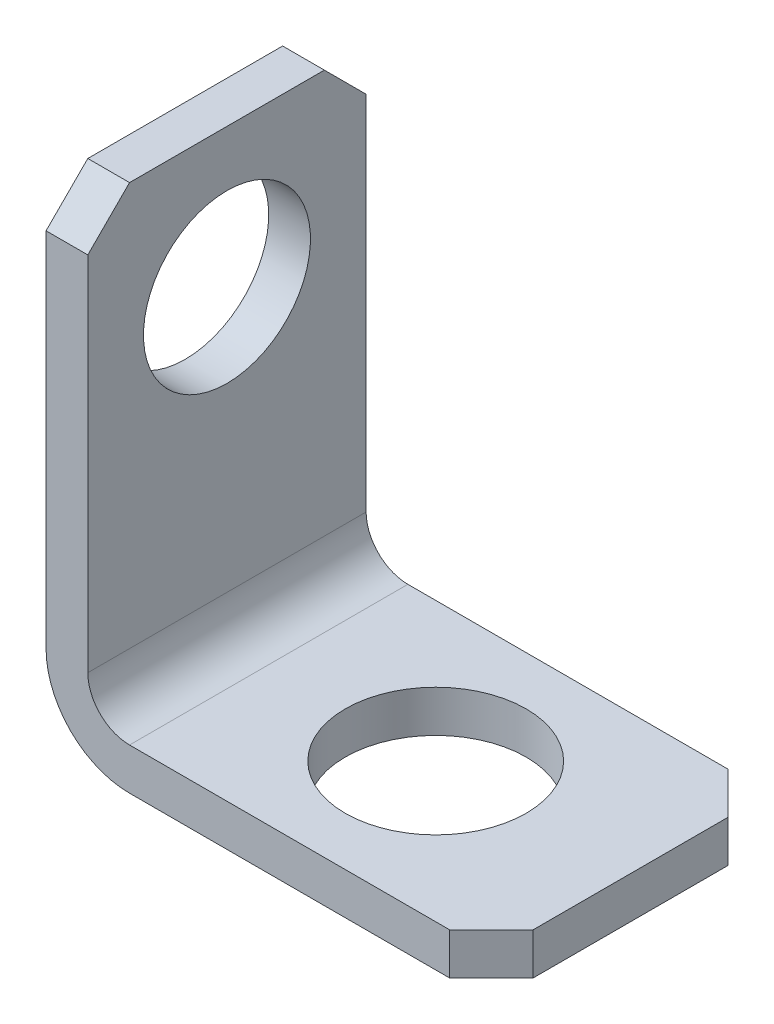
ISO-10303-21;
HEADER;
FILE_DESCRIPTION(('STEP AP214'),'2;1');
FILE_NAME('part.step','',(''),(''),'','','');
FILE_SCHEMA(('AUTOMOTIVE_DESIGN { 1 0 10303 214 1 1 1 1 }'));
ENDSEC;
DATA;
#1=APPLICATION_CONTEXT('core data for automotive mechanical design processes');
#2=APPLICATION_PROTOCOL_DEFINITION('international standard','automotive_design',2000,#1);
#3=PRODUCT_CONTEXT('',#1,'mechanical');
#4=PRODUCT('Part','Part','',(#3));
#5=PRODUCT_RELATED_PRODUCT_CATEGORY('part','',(#4));
#6=PRODUCT_DEFINITION_FORMATION('','',#4);
#7=PRODUCT_DEFINITION_CONTEXT('part definition',#1,'design');
#8=PRODUCT_DEFINITION('design','',#6,#7);
#9=PRODUCT_DEFINITION_SHAPE('','',#8);
#10=(LENGTH_UNIT() NAMED_UNIT(*) SI_UNIT(.MILLI.,.METRE.));
#11=(NAMED_UNIT(*) PLANE_ANGLE_UNIT() SI_UNIT($,.RADIAN.));
#12=(NAMED_UNIT(*) SI_UNIT($,.STERADIAN.) SOLID_ANGLE_UNIT());
#13=UNCERTAINTY_MEASURE_WITH_UNIT(LENGTH_MEASURE(1.E-05),#10,'distance_accuracy_value','');
#14=(GEOMETRIC_REPRESENTATION_CONTEXT(3) GLOBAL_UNCERTAINTY_ASSIGNED_CONTEXT((#13)) GLOBAL_UNIT_ASSIGNED_CONTEXT((#10,
#11,#12)) REPRESENTATION_CONTEXT('',''));
#15=CARTESIAN_POINT('',(0.,0.,0.));
#16=DIRECTION('',(0.,0.,1.));
#17=DIRECTION('',(1.,0.,0.));
#18=AXIS2_PLACEMENT_3D('',#15,#16,#17);
#19=CARTESIAN_POINT('',(3.,35.,20.));
#20=DIRECTION('',(0.,-1.,0.));
#21=DIRECTION('',(0.,0.,-1.));
#22=AXIS2_PLACEMENT_3D('',#19,#20,#21);
#23=PLANE('',#22);
#24=DIRECTION('',(0.,0.,-1.));
#25=VECTOR('',#24,1.);
#26=CARTESIAN_POINT('',(3.,35.,20.));
#27=LINE('',#26,#25);
#28=CARTESIAN_POINT('',(3.,35.,17.));
#29=VERTEX_POINT('',#28);
#30=CARTESIAN_POINT('',(3.,35.,3.));
#31=VERTEX_POINT('',#30);
#32=EDGE_CURVE('E140',#29,#31,#27,.T.);
#33=ORIENTED_EDGE('',*,*,#32,.T.);
#34=DIRECTION('',(-1.,0.,0.));
#35=VECTOR('',#34,1.);
#36=CARTESIAN_POINT('',(3.,35.,3.));
#37=LINE('',#36,#35);
#38=CARTESIAN_POINT('',(0.,35.,3.));
#39=VERTEX_POINT('',#38);
#40=EDGE_CURVE('E186',#31,#39,#37,.T.);
#41=ORIENTED_EDGE('',*,*,#40,.T.);
#42=DIRECTION('',(0.,0.,-1.));
#43=VECTOR('',#42,1.);
#44=CARTESIAN_POINT('',(0.,35.,20.));
#45=LINE('',#44,#43);
#46=CARTESIAN_POINT('',(0.,35.,17.));
#47=VERTEX_POINT('',#46);
#48=EDGE_CURVE('E125',#47,#39,#45,.T.);
#49=ORIENTED_EDGE('',*,*,#48,.F.);
#50=DIRECTION('',(1.,0.,0.));
#51=VECTOR('',#50,1.);
#52=CARTESIAN_POINT('',(3.,35.,17.));
#53=LINE('',#52,#51);
#54=EDGE_CURVE('E38',#47,#29,#53,.T.);
#55=ORIENTED_EDGE('',*,*,#54,.T.);
#56=EDGE_LOOP('',(#33,#41,#49,#55));
#57=FACE_BOUND('',#56,.T.);
#58=ADVANCED_FACE('F17',(#57),#23,.F.);
#59=CARTESIAN_POINT('',(0.,35.,20.));
#60=DIRECTION('',(1.,0.,0.));
#61=DIRECTION('',(0.,1.,0.));
#62=AXIS2_PLACEMENT_3D('',#59,#60,#61);
#63=PLANE('',#62);
#64=CARTESIAN_POINT('',(0.,25.,10.));
#65=DIRECTION('',(-1.,0.,0.));
#66=DIRECTION('',(0.,-1.,0.));
#67=AXIS2_PLACEMENT_3D('',#64,#65,#66);
#68=CIRCLE('',#67,6.);
#69=CARTESIAN_POINT('',(0.,19.,10.));
#70=VERTEX_POINT('',#69);
#71=EDGE_CURVE('E213',#70,#70,#68,.T.);
#72=ORIENTED_EDGE('',*,*,#71,.F.);
#73=EDGE_LOOP('',(#72));
#74=FACE_BOUND('',#73,.T.);
#75=ORIENTED_EDGE('',*,*,#48,.T.);
#76=DIRECTION('',(0.,0.707106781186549,0.707106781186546));
#77=VECTOR('',#76,1.);
#78=CARTESIAN_POINT('',(0.,35.,3.));
#79=LINE('',#78,#77);
#80=CARTESIAN_POINT('',(0.,32.,0.));
#81=VERTEX_POINT('',#80);
#82=EDGE_CURVE('E191',#39,#81,#79,.F.);
#83=ORIENTED_EDGE('',*,*,#82,.T.);
#84=DIRECTION('',(0.,-1.,0.));
#85=VECTOR('',#84,1.);
#86=CARTESIAN_POINT('',(0.,35.,0.));
#87=LINE('',#86,#85);
#88=CARTESIAN_POINT('',(0.,6.,0.));
#89=VERTEX_POINT('',#88);
#90=EDGE_CURVE('E207',#81,#89,#87,.T.);
#91=ORIENTED_EDGE('',*,*,#90,.T.);
#92=DIRECTION('',(0.,0.,-1.));
#93=VECTOR('',#92,1.);
#94=CARTESIAN_POINT('',(0.,6.,20.));
#95=LINE('',#94,#93);
#96=CARTESIAN_POINT('',(0.,6.,20.));
#97=VERTEX_POINT('',#96);
#98=EDGE_CURVE('E158',#89,#97,#95,.F.);
#99=ORIENTED_EDGE('',*,*,#98,.T.);
#100=DIRECTION('',(0.,-1.,0.));
#101=VECTOR('',#100,1.);
#102=CARTESIAN_POINT('',(0.,35.,20.));
#103=LINE('',#102,#101);
#104=CARTESIAN_POINT('',(0.,32.,20.));
#105=VERTEX_POINT('',#104);
#106=EDGE_CURVE('E131',#105,#97,#103,.T.);
#107=ORIENTED_EDGE('',*,*,#106,.F.);
#108=DIRECTION('',(0.,0.707106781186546,-0.70710678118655));
#109=VECTOR('',#108,1.);
#110=CARTESIAN_POINT('',(0.,32.,20.));
#111=LINE('',#110,#109);
#112=EDGE_CURVE('E189',#105,#47,#111,.T.);
#113=ORIENTED_EDGE('',*,*,#112,.T.);
#114=EDGE_LOOP('',(#75,#83,#91,#99,#107,#113));
#115=FACE_BOUND('',#114,.T.);
#116=ADVANCED_FACE('F203',(#74,#115),#63,.F.);
#117=CARTESIAN_POINT('',(0.,0.,20.));
#118=DIRECTION('',(0.,1.,0.));
#119=DIRECTION('',(-1.,0.,0.));
#120=AXIS2_PLACEMENT_3D('',#117,#118,#119);
#121=PLANE('',#120);
#122=CARTESIAN_POINT('',(18.,0.,10.));
#123=DIRECTION('',(0.,1.,0.));
#124=DIRECTION('',(-1.,0.,0.));
#125=AXIS2_PLACEMENT_3D('',#122,#123,#124);
#126=CIRCLE('',#125,6.5);
#127=CARTESIAN_POINT('',(11.5,0.,10.));
#128=VERTEX_POINT('',#127);
#129=EDGE_CURVE('E219',#128,#128,#126,.T.);
#130=ORIENTED_EDGE('',*,*,#129,.T.);
#131=EDGE_LOOP('',(#130));
#132=FACE_BOUND('',#131,.T.);
#133=DIRECTION('',(0.,0.,-1.));
#134=VECTOR('',#133,1.);
#135=CARTESIAN_POINT('',(32.,0.,20.));
#136=LINE('',#135,#134);
#137=CARTESIAN_POINT('',(32.,0.,17.));
#138=VERTEX_POINT('',#137);
#139=CARTESIAN_POINT('',(32.,0.,3.));
#140=VERTEX_POINT('',#139);
#141=EDGE_CURVE('E145',#138,#140,#136,.T.);
#142=ORIENTED_EDGE('',*,*,#141,.F.);
#143=DIRECTION('',(-0.707106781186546,0.,0.707106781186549));
#144=VECTOR('',#143,1.);
#145=CARTESIAN_POINT('',(29.,0.,20.));
#146=LINE('',#145,#144);
#147=CARTESIAN_POINT('',(29.,0.,20.));
#148=VERTEX_POINT('',#147);
#149=EDGE_CURVE('E180',#138,#148,#146,.T.);
#150=ORIENTED_EDGE('',*,*,#149,.T.);
#151=DIRECTION('',(1.,0.,0.));
#152=VECTOR('',#151,1.);
#153=CARTESIAN_POINT('',(0.,0.,20.));
#154=LINE('',#153,#152);
#155=CARTESIAN_POINT('',(6.,0.,20.));
#156=VERTEX_POINT('',#155);
#157=EDGE_CURVE('E134',#156,#148,#154,.T.);
#158=ORIENTED_EDGE('',*,*,#157,.F.);
#159=DIRECTION('',(0.,0.,-1.));
#160=VECTOR('',#159,1.);
#161=CARTESIAN_POINT('',(6.,0.,20.));
#162=LINE('',#161,#160);
#163=CARTESIAN_POINT('',(6.,0.,0.));
#164=VERTEX_POINT('',#163);
#165=EDGE_CURVE('E152',#156,#164,#162,.T.);
#166=ORIENTED_EDGE('',*,*,#165,.T.);
#167=DIRECTION('',(1.,0.,0.));
#168=VECTOR('',#167,1.);
#169=CARTESIAN_POINT('',(0.,0.,0.));
#170=LINE('',#169,#168);
#171=CARTESIAN_POINT('',(29.,0.,0.));
#172=VERTEX_POINT('',#171);
#173=EDGE_CURVE('E136',#164,#172,#170,.T.);
#174=ORIENTED_EDGE('',*,*,#173,.T.);
#175=DIRECTION('',(-0.707106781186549,0.,-0.707106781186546));
#176=VECTOR('',#175,1.);
#177=CARTESIAN_POINT('',(32.,0.,3.));
#178=LINE('',#177,#176);
#179=EDGE_CURVE('E178',#172,#140,#178,.F.);
#180=ORIENTED_EDGE('',*,*,#179,.T.);
#181=EDGE_LOOP('',(#142,#150,#158,#166,#174,#180));
#182=FACE_BOUND('',#181,.T.);
#183=ADVANCED_FACE('F226',(#132,#182),#121,.F.);
#184=CARTESIAN_POINT('',(32.,0.,20.));
#185=DIRECTION('',(-1.,0.,0.));
#186=DIRECTION('',(0.,-1.,0.));
#187=AXIS2_PLACEMENT_3D('',#184,#185,#186);
#188=PLANE('',#187);
#189=DIRECTION('',(0.,0.,-1.));
#190=VECTOR('',#189,1.);
#191=CARTESIAN_POINT('',(32.,3.,20.));
#192=LINE('',#191,#190);
#193=CARTESIAN_POINT('',(32.,3.,17.));
#194=VERTEX_POINT('',#193);
#195=CARTESIAN_POINT('',(32.,3.,3.));
#196=VERTEX_POINT('',#195);
#197=EDGE_CURVE('E142',#194,#196,#192,.T.);
#198=ORIENTED_EDGE('',*,*,#197,.F.);
#199=DIRECTION('',(0.,-1.,0.));
#200=VECTOR('',#199,1.);
#201=CARTESIAN_POINT('',(32.,0.,17.));
#202=LINE('',#201,#200);
#203=EDGE_CURVE('E176',#194,#138,#202,.T.);
#204=ORIENTED_EDGE('',*,*,#203,.T.);
#205=ORIENTED_EDGE('',*,*,#141,.T.);
#206=DIRECTION('',(0.,1.,0.));
#207=VECTOR('',#206,1.);
#208=CARTESIAN_POINT('',(32.,0.,3.));
#209=LINE('',#208,#207);
#210=EDGE_CURVE('E173',#140,#196,#209,.T.);
#211=ORIENTED_EDGE('',*,*,#210,.T.);
#212=EDGE_LOOP('',(#198,#204,#205,#211));
#213=FACE_BOUND('',#212,.T.);
#214=ADVANCED_FACE('F239',(#213),#188,.F.);
#215=CARTESIAN_POINT('',(32.,3.,20.));
#216=DIRECTION('',(0.,-1.,0.));
#217=DIRECTION('',(1.,0.,0.));
#218=AXIS2_PLACEMENT_3D('',#215,#216,#217);
#219=PLANE('',#218);
#220=CARTESIAN_POINT('',(18.,3.,10.));
#221=DIRECTION('',(0.,1.,0.));
#222=DIRECTION('',(-1.,0.,0.));
#223=AXIS2_PLACEMENT_3D('',#220,#221,#222);
#224=CIRCLE('',#223,6.5);
#225=CARTESIAN_POINT('',(11.5,3.,10.));
#226=VERTEX_POINT('',#225);
#227=EDGE_CURVE('E220',#226,#226,#224,.T.);
#228=ORIENTED_EDGE('',*,*,#227,.F.);
#229=EDGE_LOOP('',(#228));
#230=FACE_BOUND('',#229,.T.);
#231=DIRECTION('',(-1.,0.,0.));
#232=VECTOR('',#231,1.);
#233=CARTESIAN_POINT('',(32.,3.,20.));
#234=LINE('',#233,#232);
#235=CARTESIAN_POINT('',(29.,3.,20.));
#236=VERTEX_POINT('',#235);
#237=CARTESIAN_POINT('',(6.,3.,20.));
#238=VERTEX_POINT('',#237);
#239=EDGE_CURVE('E200',#236,#238,#234,.T.);
#240=ORIENTED_EDGE('',*,*,#239,.F.);
#241=DIRECTION('',(0.707106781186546,0.,-0.707106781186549));
#242=VECTOR('',#241,1.);
#243=CARTESIAN_POINT('',(29.,3.,20.));
#244=LINE('',#243,#242);
#245=EDGE_CURVE('E171',#236,#194,#244,.T.);
#246=ORIENTED_EDGE('',*,*,#245,.T.);
#247=ORIENTED_EDGE('',*,*,#197,.T.);
#248=DIRECTION('',(0.707106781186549,0.,0.707106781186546));
#249=VECTOR('',#248,1.);
#250=CARTESIAN_POINT('',(32.,3.,3.));
#251=LINE('',#250,#249);
#252=CARTESIAN_POINT('',(29.,3.,0.));
#253=VERTEX_POINT('',#252);
#254=EDGE_CURVE('E169',#196,#253,#251,.F.);
#255=ORIENTED_EDGE('',*,*,#254,.T.);
#256=DIRECTION('',(-1.,0.,0.));
#257=VECTOR('',#256,1.);
#258=CARTESIAN_POINT('',(32.,3.,0.));
#259=LINE('',#258,#257);
#260=CARTESIAN_POINT('',(6.,3.,0.));
#261=VERTEX_POINT('',#260);
#262=EDGE_CURVE('E132',#253,#261,#259,.T.);
#263=ORIENTED_EDGE('',*,*,#262,.T.);
#264=DIRECTION('',(0.,0.,-1.));
#265=VECTOR('',#264,1.);
#266=CARTESIAN_POINT('',(6.,3.,20.));
#267=LINE('',#266,#265);
#268=EDGE_CURVE('E114',#261,#238,#267,.F.);
#269=ORIENTED_EDGE('',*,*,#268,.T.);
#270=EDGE_LOOP('',(#240,#246,#247,#255,#263,#269));
#271=FACE_BOUND('',#270,.T.);
#272=ADVANCED_FACE('F236',(#230,#271),#219,.F.);
#273=CARTESIAN_POINT('',(3.,3.,20.));
#274=DIRECTION('',(-1.,0.,0.));
#275=DIRECTION('',(0.,-1.,0.));
#276=AXIS2_PLACEMENT_3D('',#273,#274,#275);
#277=PLANE('',#276);
#278=CARTESIAN_POINT('',(3.,25.,10.));
#279=DIRECTION('',(-1.,0.,0.));
#280=DIRECTION('',(0.,-1.,0.));
#281=AXIS2_PLACEMENT_3D('',#278,#279,#280);
#282=CIRCLE('',#281,6.);
#283=CARTESIAN_POINT('',(3.,19.,10.));
#284=VERTEX_POINT('',#283);
#285=EDGE_CURVE('E21',#284,#284,#282,.T.);
#286=ORIENTED_EDGE('',*,*,#285,.T.);
#287=EDGE_LOOP('',(#286));
#288=FACE_BOUND('',#287,.T.);
#289=DIRECTION('',(0.,1.,0.));
#290=VECTOR('',#289,1.);
#291=CARTESIAN_POINT('',(3.,3.,0.));
#292=LINE('',#291,#290);
#293=CARTESIAN_POINT('',(3.,6.,0.));
#294=VERTEX_POINT('',#293);
#295=CARTESIAN_POINT('',(3.,32.,0.));
#296=VERTEX_POINT('',#295);
#297=EDGE_CURVE('E122',#294,#296,#292,.T.);
#298=ORIENTED_EDGE('',*,*,#297,.T.);
#299=DIRECTION('',(0.,-0.707106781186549,-0.707106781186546));
#300=VECTOR('',#299,1.);
#301=CARTESIAN_POINT('',(3.,35.,3.));
#302=LINE('',#301,#300);
#303=EDGE_CURVE('E11',#296,#31,#302,.F.);
#304=ORIENTED_EDGE('',*,*,#303,.T.);
#305=ORIENTED_EDGE('',*,*,#32,.F.);
#306=DIRECTION('',(0.,-0.707106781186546,0.70710678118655));
#307=VECTOR('',#306,1.);
#308=CARTESIAN_POINT('',(3.,32.,20.));
#309=LINE('',#308,#307);
#310=CARTESIAN_POINT('',(3.,32.,20.));
#311=VERTEX_POINT('',#310);
#312=EDGE_CURVE('E26',#29,#311,#309,.T.);
#313=ORIENTED_EDGE('',*,*,#312,.T.);
#314=DIRECTION('',(0.,1.,0.));
#315=VECTOR('',#314,1.);
#316=CARTESIAN_POINT('',(3.,3.,20.));
#317=LINE('',#316,#315);
#318=CARTESIAN_POINT('',(3.,6.,20.));
#319=VERTEX_POINT('',#318);
#320=EDGE_CURVE('E124',#319,#311,#317,.T.);
#321=ORIENTED_EDGE('',*,*,#320,.F.);
#322=DIRECTION('',(0.,0.,-1.));
#323=VECTOR('',#322,1.);
#324=CARTESIAN_POINT('',(3.,6.,0.));
#325=LINE('',#324,#323);
#326=EDGE_CURVE('E112',#319,#294,#325,.T.);
#327=ORIENTED_EDGE('',*,*,#326,.T.);
#328=EDGE_LOOP('',(#298,#304,#305,#313,#321,#327));
#329=FACE_BOUND('',#328,.T.);
#330=ADVANCED_FACE('F121',(#288,#329),#277,.F.);
#331=CARTESIAN_POINT('',(0.,35.,20.));
#332=DIRECTION('',(0.,0.,1.));
#333=DIRECTION('',(1.,0.,0.));
#334=AXIS2_PLACEMENT_3D('',#331,#332,#333);
#335=PLANE('',#334);
#336=ORIENTED_EDGE('',*,*,#157,.T.);
#337=DIRECTION('',(0.,1.,0.));
#338=VECTOR('',#337,1.);
#339=CARTESIAN_POINT('',(29.,3.,20.));
#340=LINE('',#339,#338);
#341=EDGE_CURVE('E166',#148,#236,#340,.T.);
#342=ORIENTED_EDGE('',*,*,#341,.T.);
#343=ORIENTED_EDGE('',*,*,#239,.T.);
#344=CARTESIAN_POINT('',(6.,6.,20.));
#345=DIRECTION('',(0.,0.,1.));
#346=DIRECTION('',(1.,0.,0.));
#347=AXIS2_PLACEMENT_3D('',#344,#345,#346);
#348=CIRCLE('',#347,3.);
#349=EDGE_CURVE('E118',#238,#319,#348,.F.);
#350=ORIENTED_EDGE('',*,*,#349,.T.);
#351=ORIENTED_EDGE('',*,*,#320,.T.);
#352=DIRECTION('',(-1.,0.,0.));
#353=VECTOR('',#352,1.);
#354=CARTESIAN_POINT('',(0.,32.,20.));
#355=LINE('',#354,#353);
#356=EDGE_CURVE('E163',#311,#105,#355,.T.);
#357=ORIENTED_EDGE('',*,*,#356,.T.);
#358=ORIENTED_EDGE('',*,*,#106,.T.);
#359=CARTESIAN_POINT('',(6.,6.,20.));
#360=DIRECTION('',(0.,0.,1.));
#361=DIRECTION('',(1.,0.,0.));
#362=AXIS2_PLACEMENT_3D('',#359,#360,#361);
#363=CIRCLE('',#362,6.);
#364=EDGE_CURVE('E161',#97,#156,#363,.T.);
#365=ORIENTED_EDGE('',*,*,#364,.T.);
#366=EDGE_LOOP('',(#336,#342,#343,#350,#351,#357,#358,#365));
#367=FACE_BOUND('',#366,.T.);
#368=ADVANCED_FACE('F198',(#367),#335,.T.);
#369=CARTESIAN_POINT('',(0.,35.,0.));
#370=DIRECTION('',(0.,0.,1.));
#371=DIRECTION('',(1.,0.,0.));
#372=AXIS2_PLACEMENT_3D('',#369,#370,#371);
#373=PLANE('',#372);
#374=ORIENTED_EDGE('',*,*,#262,.F.);
#375=DIRECTION('',(0.,-1.,0.));
#376=VECTOR('',#375,1.);
#377=CARTESIAN_POINT('',(29.,35.,0.));
#378=LINE('',#377,#376);
#379=EDGE_CURVE('E183',#253,#172,#378,.T.);
#380=ORIENTED_EDGE('',*,*,#379,.T.);
#381=ORIENTED_EDGE('',*,*,#173,.F.);
#382=CARTESIAN_POINT('',(6.,6.,0.));
#383=DIRECTION('',(0.,0.,1.));
#384=DIRECTION('',(1.,0.,0.));
#385=AXIS2_PLACEMENT_3D('',#382,#383,#384);
#386=CIRCLE('',#385,6.);
#387=EDGE_CURVE('E155',#164,#89,#386,.F.);
#388=ORIENTED_EDGE('',*,*,#387,.T.);
#389=ORIENTED_EDGE('',*,*,#90,.F.);
#390=DIRECTION('',(1.,0.,0.));
#391=VECTOR('',#390,1.);
#392=CARTESIAN_POINT('',(0.,32.,0.));
#393=LINE('',#392,#391);
#394=EDGE_CURVE('E130',#81,#296,#393,.T.);
#395=ORIENTED_EDGE('',*,*,#394,.T.);
#396=ORIENTED_EDGE('',*,*,#297,.F.);
#397=CARTESIAN_POINT('',(6.,6.,0.));
#398=DIRECTION('',(0.,0.,1.));
#399=DIRECTION('',(1.,0.,0.));
#400=AXIS2_PLACEMENT_3D('',#397,#398,#399);
#401=CIRCLE('',#400,3.);
#402=EDGE_CURVE('E108',#294,#261,#401,.T.);
#403=ORIENTED_EDGE('',*,*,#402,.T.);
#404=EDGE_LOOP('',(#374,#380,#381,#388,#389,#395,#396,#403));
#405=FACE_BOUND('',#404,.T.);
#406=ADVANCED_FACE('F127',(#405),#373,.F.);
#407=CARTESIAN_POINT('',(6.,6.,20.));
#408=DIRECTION('',(0.,0.,1.));
#409=DIRECTION('',(1.,0.,0.));
#410=AXIS2_PLACEMENT_3D('',#407,#408,#409);
#411=CYLINDRICAL_SURFACE('',#410,3.);
#412=ORIENTED_EDGE('',*,*,#349,.F.);
#413=ORIENTED_EDGE('',*,*,#268,.F.);
#414=ORIENTED_EDGE('',*,*,#402,.F.);
#415=ORIENTED_EDGE('',*,*,#326,.F.);
#416=EDGE_LOOP('',(#412,#413,#414,#415));
#417=FACE_BOUND('',#416,.T.);
#418=ADVANCED_FACE('F111',(#417),#411,.F.);
#419=CARTESIAN_POINT('',(6.,6.,20.));
#420=DIRECTION('',(0.,0.,-1.));
#421=DIRECTION('',(-1.,0.,0.));
#422=AXIS2_PLACEMENT_3D('',#419,#420,#421);
#423=CYLINDRICAL_SURFACE('',#422,6.);
#424=ORIENTED_EDGE('',*,*,#364,.F.);
#425=ORIENTED_EDGE('',*,*,#98,.F.);
#426=ORIENTED_EDGE('',*,*,#387,.F.);
#427=ORIENTED_EDGE('',*,*,#165,.F.);
#428=EDGE_LOOP('',(#424,#425,#426,#427));
#429=FACE_BOUND('',#428,.T.);
#430=ADVANCED_FACE('F264',(#429),#423,.T.);
#431=CARTESIAN_POINT('',(29.,35.,20.));
#432=DIRECTION('',(0.707106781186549,0.,0.707106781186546));
#433=DIRECTION('',(0.707106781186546,0.,-0.707106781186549));
#434=AXIS2_PLACEMENT_3D('',#431,#432,#433);
#435=PLANE('',#434);
#436=ORIENTED_EDGE('',*,*,#149,.F.);
#437=ORIENTED_EDGE('',*,*,#203,.F.);
#438=ORIENTED_EDGE('',*,*,#245,.F.);
#439=ORIENTED_EDGE('',*,*,#341,.F.);
#440=EDGE_LOOP('',(#436,#437,#438,#439));
#441=FACE_BOUND('',#440,.T.);
#442=ADVANCED_FACE('F247',(#441),#435,.T.);
#443=CARTESIAN_POINT('',(32.,0.,3.));
#444=DIRECTION('',(-0.707106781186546,0.,0.707106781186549));
#445=DIRECTION('',(0.707106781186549,0.,0.707106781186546));
#446=AXIS2_PLACEMENT_3D('',#443,#444,#445);
#447=PLANE('',#446);
#448=ORIENTED_EDGE('',*,*,#179,.F.);
#449=ORIENTED_EDGE('',*,*,#379,.F.);
#450=ORIENTED_EDGE('',*,*,#254,.F.);
#451=ORIENTED_EDGE('',*,*,#210,.F.);
#452=EDGE_LOOP('',(#448,#449,#450,#451));
#453=FACE_BOUND('',#452,.T.);
#454=ADVANCED_FACE('F255',(#453),#447,.F.);
#455=CARTESIAN_POINT('',(3.,35.,3.));
#456=DIRECTION('',(0.,-0.707106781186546,0.707106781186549));
#457=DIRECTION('',(0.,-0.707106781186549,-0.707106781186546));
#458=AXIS2_PLACEMENT_3D('',#455,#456,#457);
#459=PLANE('',#458);
#460=ORIENTED_EDGE('',*,*,#303,.F.);
#461=ORIENTED_EDGE('',*,*,#394,.F.);
#462=ORIENTED_EDGE('',*,*,#82,.F.);
#463=ORIENTED_EDGE('',*,*,#40,.F.);
#464=EDGE_LOOP('',(#460,#461,#462,#463));
#465=FACE_BOUND('',#464,.T.);
#466=ADVANCED_FACE('F206',(#465),#459,.F.);
#467=CARTESIAN_POINT('',(0.,32.,20.));
#468=DIRECTION('',(0.,0.70710678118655,0.707106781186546));
#469=DIRECTION('',(0.,-0.707106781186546,0.70710678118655));
#470=AXIS2_PLACEMENT_3D('',#467,#468,#469);
#471=PLANE('',#470);
#472=ORIENTED_EDGE('',*,*,#312,.F.);
#473=ORIENTED_EDGE('',*,*,#54,.F.);
#474=ORIENTED_EDGE('',*,*,#112,.F.);
#475=ORIENTED_EDGE('',*,*,#356,.F.);
#476=EDGE_LOOP('',(#472,#473,#474,#475));
#477=FACE_BOUND('',#476,.T.);
#478=ADVANCED_FACE('F19',(#477),#471,.T.);
#479=CARTESIAN_POINT('',(32.,25.,10.));
#480=DIRECTION('',(-1.,0.,0.));
#481=DIRECTION('',(0.,-1.,0.));
#482=AXIS2_PLACEMENT_3D('',#479,#480,#481);
#483=CYLINDRICAL_SURFACE('',#482,6.);
#484=ORIENTED_EDGE('',*,*,#71,.T.);
#485=EDGE_LOOP('',(#484));
#486=FACE_BOUND('',#485,.T.);
#487=ORIENTED_EDGE('',*,*,#285,.F.);
#488=EDGE_LOOP('',(#487));
#489=FACE_BOUND('',#488,.T.);
#490=ADVANCED_FACE('F232',(#486,#489),#483,.F.);
#491=CARTESIAN_POINT('',(18.,0.,10.));
#492=DIRECTION('',(0.,1.,0.));
#493=DIRECTION('',(-1.,0.,0.));
#494=AXIS2_PLACEMENT_3D('',#491,#492,#493);
#495=CYLINDRICAL_SURFACE('',#494,6.5);
#496=ORIENTED_EDGE('',*,*,#129,.F.);
#497=EDGE_LOOP('',(#496));
#498=FACE_BOUND('',#497,.T.);
#499=ORIENTED_EDGE('',*,*,#227,.T.);
#500=EDGE_LOOP('',(#499));
#501=FACE_BOUND('',#500,.T.);
#502=ADVANCED_FACE('F229',(#498,#501),#495,.F.);
#503=CLOSED_SHELL('',(#58,#116,#183,#214,#272,#330,#368,#406,#418,#430,#442,#454,#466,#478,#490,#502));
#504=MANIFOLD_SOLID_BREP('B1',#503);
#505=ADVANCED_BREP_SHAPE_REPRESENTATION('',(#18,#504),#14);
#506=SHAPE_DEFINITION_REPRESENTATION(#9,#505);
ENDSEC;
END-ISO-10303-21;
